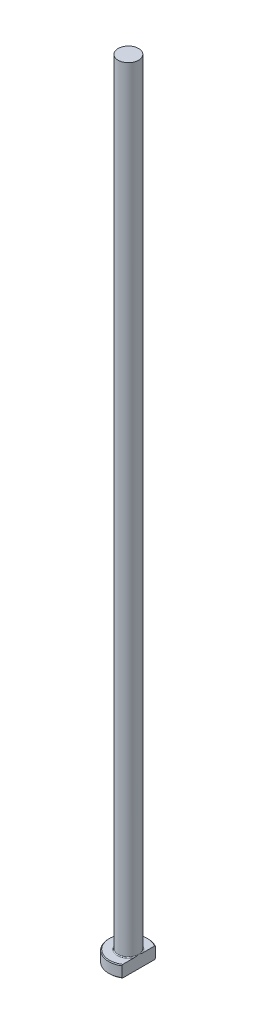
ISO-10303-21;
HEADER;
FILE_DESCRIPTION(('STEP AP214'),'2;1');
FILE_NAME('part.step','',(''),(''),'','','');
FILE_SCHEMA(('AUTOMOTIVE_DESIGN { 1 0 10303 214 1 1 1 1 }'));
ENDSEC;
DATA;
#1=APPLICATION_CONTEXT('core data for automotive mechanical design processes');
#2=APPLICATION_PROTOCOL_DEFINITION('international standard','automotive_design',2000,#1);
#3=PRODUCT_CONTEXT('',#1,'mechanical');
#4=PRODUCT('Part','Part','',(#3));
#5=PRODUCT_RELATED_PRODUCT_CATEGORY('part','',(#4));
#6=PRODUCT_DEFINITION_FORMATION('','',#4);
#7=PRODUCT_DEFINITION_CONTEXT('part definition',#1,'design');
#8=PRODUCT_DEFINITION('design','',#6,#7);
#9=PRODUCT_DEFINITION_SHAPE('','',#8);
#10=(LENGTH_UNIT() NAMED_UNIT(*) SI_UNIT(.MILLI.,.METRE.));
#11=(NAMED_UNIT(*) PLANE_ANGLE_UNIT() SI_UNIT($,.RADIAN.));
#12=(NAMED_UNIT(*) SI_UNIT($,.STERADIAN.) SOLID_ANGLE_UNIT());
#13=UNCERTAINTY_MEASURE_WITH_UNIT(LENGTH_MEASURE(1.E-05),#10,'distance_accuracy_value','');
#14=(GEOMETRIC_REPRESENTATION_CONTEXT(3) GLOBAL_UNCERTAINTY_ASSIGNED_CONTEXT((#13)) GLOBAL_UNIT_ASSIGNED_CONTEXT((#10,
#11,#12)) REPRESENTATION_CONTEXT('',''));
#15=CARTESIAN_POINT('',(0.,0.,0.));
#16=DIRECTION('',(0.,0.,1.));
#17=DIRECTION('',(1.,0.,0.));
#18=AXIS2_PLACEMENT_3D('',#15,#16,#17);
#19=CARTESIAN_POINT('',(0.,0.,0.));
#20=DIRECTION('',(0.,-1.,0.));
#21=DIRECTION('',(0.,0.,-1.));
#22=AXIS2_PLACEMENT_3D('',#19,#20,#21);
#23=PLANE('',#22);
#24=CARTESIAN_POINT('',(0.,0.,0.));
#25=DIRECTION('',(0.,-1.,0.));
#26=DIRECTION('',(0.,0.,-1.));
#27=AXIS2_PLACEMENT_3D('',#24,#25,#26);
#28=CIRCLE('',#27,4.79999999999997);
#29=CARTESIAN_POINT('',(2.59999999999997,0.,4.03484820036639));
#30=VERTEX_POINT('',#29);
#31=CARTESIAN_POINT('',(2.59999999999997,0.,-4.03484820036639));
#32=VERTEX_POINT('',#31);
#33=EDGE_CURVE('E98',#30,#32,#28,.T.);
#34=ORIENTED_EDGE('',*,*,#33,.T.);
#35=DIRECTION('',(0.,0.,1.));
#36=VECTOR('',#35,1.);
#37=CARTESIAN_POINT('',(2.59999999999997,0.,-4.27083130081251));
#38=LINE('',#37,#36);
#39=EDGE_CURVE('E83',#32,#30,#38,.T.);
#40=ORIENTED_EDGE('',*,*,#39,.T.);
#41=EDGE_LOOP('',(#34,#40));
#42=FACE_BOUND('',#41,.T.);
#43=ADVANCED_FACE('F32',(#42),#23,.T.);
#44=CARTESIAN_POINT('',(0.,259.958771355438,0.));
#45=DIRECTION('',(0.,1.,0.));
#46=DIRECTION('',(0.,0.,1.));
#47=AXIS2_PLACEMENT_3D('',#44,#45,#46);
#48=CYLINDRICAL_SURFACE('',#47,4.99999999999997);
#49=CARTESIAN_POINT('',(0.,2.79999999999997,0.));
#50=DIRECTION('',(0.,1.,0.));
#51=DIRECTION('',(0.,0.,1.));
#52=AXIS2_PLACEMENT_3D('',#49,#50,#51);
#53=CIRCLE('',#52,4.99999999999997);
#54=CARTESIAN_POINT('',(2.59999999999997,2.79999999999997,4.27083130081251));
#55=VERTEX_POINT('',#54);
#56=CARTESIAN_POINT('',(2.59999999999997,2.79999999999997,-4.27083130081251));
#57=VERTEX_POINT('',#56);
#58=EDGE_CURVE('E104',#55,#57,#53,.F.);
#59=ORIENTED_EDGE('',*,*,#58,.T.);
#60=DIRECTION('',(0.,-1.,0.));
#61=VECTOR('',#60,1.);
#62=CARTESIAN_POINT('',(2.59999999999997,200.,-4.27083130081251));
#63=LINE('',#62,#61);
#64=CARTESIAN_POINT('',(2.59999999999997,0.200000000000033,-4.27083130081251));
#65=VERTEX_POINT('',#64);
#66=EDGE_CURVE('E183',#57,#65,#63,.T.);
#67=ORIENTED_EDGE('',*,*,#66,.T.);
#68=CARTESIAN_POINT('',(0.,0.200000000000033,0.));
#69=DIRECTION('',(0.,-1.,0.));
#70=DIRECTION('',(0.,0.,-1.));
#71=AXIS2_PLACEMENT_3D('',#68,#69,#70);
#72=CIRCLE('',#71,4.99999999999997);
#73=CARTESIAN_POINT('',(2.59999999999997,0.200000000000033,4.27083130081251));
#74=VERTEX_POINT('',#73);
#75=EDGE_CURVE('E100',#65,#74,#72,.F.);
#76=ORIENTED_EDGE('',*,*,#75,.T.);
#77=DIRECTION('',(0.,-1.,0.));
#78=VECTOR('',#77,1.);
#79=CARTESIAN_POINT('',(2.59999999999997,200.,4.27083130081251));
#80=LINE('',#79,#78);
#81=EDGE_CURVE('E93',#55,#74,#80,.T.);
#82=ORIENTED_EDGE('',*,*,#81,.F.);
#83=EDGE_LOOP('',(#59,#67,#76,#82));
#84=FACE_BOUND('',#83,.T.);
#85=ADVANCED_FACE('F158',(#84),#48,.T.);
#86=CARTESIAN_POINT('',(-4.99999999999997,3.,0.));
#87=DIRECTION('',(0.,1.,0.));
#88=DIRECTION('',(0.,0.,1.));
#89=AXIS2_PLACEMENT_3D('',#86,#87,#88);
#90=PLANE('',#89);
#91=CARTESIAN_POINT('',(0.,3.,0.));
#92=DIRECTION('',(0.,1.,0.));
#93=DIRECTION('',(0.,0.,1.));
#94=AXIS2_PLACEMENT_3D('',#91,#92,#93);
#95=CIRCLE('',#94,4.79999999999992);
#96=CARTESIAN_POINT('',(2.59999999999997,3.,-4.03484820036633));
#97=VERTEX_POINT('',#96);
#98=CARTESIAN_POINT('',(2.59999999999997,3.,4.03484820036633));
#99=VERTEX_POINT('',#98);
#100=EDGE_CURVE('E178',#97,#99,#95,.T.);
#101=ORIENTED_EDGE('',*,*,#100,.T.);
#102=DIRECTION('',(0.,0.,-1.));
#103=VECTOR('',#102,1.);
#104=CARTESIAN_POINT('',(2.59999999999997,3.,0.));
#105=LINE('',#104,#103);
#106=CARTESIAN_POINT('',(2.59999999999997,2.99999999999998,1.03923048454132));
#107=VERTEX_POINT('',#106);
#108=EDGE_CURVE('E57',#99,#107,#105,.T.);
#109=ORIENTED_EDGE('',*,*,#108,.T.);
#110=CARTESIAN_POINT('',(0.,3.,0.));
#111=DIRECTION('',(0.,1.,0.));
#112=DIRECTION('',(0.,0.,1.));
#113=AXIS2_PLACEMENT_3D('',#110,#111,#112);
#114=CIRCLE('',#113,2.79999999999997);
#115=CARTESIAN_POINT('',(2.59999999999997,2.99999999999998,-1.03923048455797));
#116=VERTEX_POINT('',#115);
#117=EDGE_CURVE('E107',#107,#116,#114,.F.);
#118=ORIENTED_EDGE('',*,*,#117,.T.);
#119=EDGE_CURVE('E136',#116,#97,#105,.T.);
#120=ORIENTED_EDGE('',*,*,#119,.T.);
#121=EDGE_LOOP('',(#101,#109,#118,#120));
#122=FACE_BOUND('',#121,.T.);
#123=ADVANCED_FACE('F147',(#122),#90,.T.);
#124=CARTESIAN_POINT('',(0.,3.,0.));
#125=DIRECTION('',(0.,-1.,0.));
#126=DIRECTION('',(0.,0.,-1.));
#127=AXIS2_PLACEMENT_3D('',#124,#125,#126);
#128=CONICAL_SURFACE('',#127,4.79999999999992,0.785398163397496);
#129=ORIENTED_EDGE('',*,*,#58,.F.);
#130=CARTESIAN_POINT('',(2.59999999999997,-1.95047472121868,9.397433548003));
#131=CARTESIAN_POINT('',(2.59999999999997,-1.76015203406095,9.19995130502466));
#132=CARTESIAN_POINT('',(2.59999999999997,-1.57004107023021,9.0022644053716));
#133=CARTESIAN_POINT('',(2.59999999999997,-1.19035454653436,8.60637345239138));
#134=CARTESIAN_POINT('',(2.59999999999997,-1.00077899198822,8.40816939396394));
#135=CARTESIAN_POINT('',(2.59999999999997,-0.622208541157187,8.01106626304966));
#136=CARTESIAN_POINT('',(2.59999999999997,-0.43321388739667,7.81216695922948));
#137=CARTESIAN_POINT('',(2.59999999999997,-0.0560371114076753,7.41360059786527));
#138=CARTESIAN_POINT('',(2.59999999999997,0.132145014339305,7.21393354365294));
#139=CARTESIAN_POINT('',(2.59999999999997,0.504316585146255,6.81701377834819));
#140=CARTESIAN_POINT('',(2.59999999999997,0.688323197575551,6.61977717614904));
#141=CARTESIAN_POINT('',(2.59999999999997,1.05506202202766,6.22412305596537));
#142=CARTESIAN_POINT('',(2.59999999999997,1.23779424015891,6.02570554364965));
#143=CARTESIAN_POINT('',(2.59999999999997,1.60155525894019,5.62737135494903));
#144=CARTESIAN_POINT('',(2.59999999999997,1.78258432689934,5.42745492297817));
#145=CARTESIAN_POINT('',(2.59999999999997,2.14238277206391,5.02560172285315));
#146=CARTESIAN_POINT('',(2.59999999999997,2.32115220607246,4.82366500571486));
#147=CARTESIAN_POINT('',(2.59999999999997,2.62527031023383,4.4746966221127));
#148=CARTESIAN_POINT('',(2.59999999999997,2.75138938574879,4.32833728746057));
#149=CARTESIAN_POINT('',(2.59999999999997,3.00151582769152,4.03379615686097));
#150=CARTESIAN_POINT('',(2.59999999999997,3.12552298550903,3.88561418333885));
#151=CARTESIAN_POINT('',(2.59999999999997,3.37190002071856,3.58545728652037));
#152=CARTESIAN_POINT('',(2.59999999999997,3.49424212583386,3.43345946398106));
#153=CARTESIAN_POINT('',(2.59999999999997,3.73490070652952,3.12636139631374));
#154=CARTESIAN_POINT('',(2.59999999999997,3.85321820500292,2.97126195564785));
#155=CARTESIAN_POINT('',(2.59999999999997,4.08579009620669,2.65464223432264));
#156=CARTESIAN_POINT('',(2.59999999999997,4.19996477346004,2.49306256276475));
#157=CARTESIAN_POINT('',(2.59999999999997,4.36468341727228,2.24613590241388));
#158=CARTESIAN_POINT('',(2.59999999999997,4.41853818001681,2.16300143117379));
#159=CARTESIAN_POINT('',(2.59999999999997,4.52346182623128,1.99499855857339));
#160=CARTESIAN_POINT('',(2.59999999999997,4.57453099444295,1.9101303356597));
#161=CARTESIAN_POINT('',(2.59999999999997,4.67263274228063,1.7393256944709));
#162=CARTESIAN_POINT('',(2.59999999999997,4.7197040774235,1.65341183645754));
#163=CARTESIAN_POINT('',(2.59999999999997,4.80952240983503,1.47936505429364));
#164=CARTESIAN_POINT('',(2.59999999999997,4.85226857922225,1.3912317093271));
#165=CARTESIAN_POINT('',(2.59999999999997,4.97211006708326,1.12354274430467));
#166=CARTESIAN_POINT('',(2.59999999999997,5.04118725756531,0.940070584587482));
#167=CARTESIAN_POINT('',(2.59999999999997,5.11752261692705,0.665284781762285));
#168=CARTESIAN_POINT('',(2.59999999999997,5.13802992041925,0.577624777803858));
#169=CARTESIAN_POINT('',(2.59999999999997,5.17073291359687,0.400736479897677));
#170=CARTESIAN_POINT('',(2.59999999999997,5.18292955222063,0.311508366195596));
#171=CARTESIAN_POINT('',(2.59999999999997,5.19813789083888,0.13262811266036));
#172=CARTESIAN_POINT('',(2.59999999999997,5.20118701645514,0.0429792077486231));
#173=CARTESIAN_POINT('',(2.59999999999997,5.19797827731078,-0.13615453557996));
#174=CARTESIAN_POINT('',(2.59999999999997,5.19171987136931,-0.225639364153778));
#175=CARTESIAN_POINT('',(2.59999999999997,5.17043196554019,-0.402893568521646));
#176=CARTESIAN_POINT('',(2.59999999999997,5.15546490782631,-0.49067060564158));
#177=CARTESIAN_POINT('',(2.59999999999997,5.11776551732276,-0.664523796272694));
#178=CARTESIAN_POINT('',(2.59999999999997,5.09503206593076,-0.750599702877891));
#179=CARTESIAN_POINT('',(2.59999999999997,5.04281440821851,-0.921261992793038));
#180=CARTESIAN_POINT('',(2.59999999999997,5.01328729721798,-1.00583506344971));
#181=CARTESIAN_POINT('',(2.59999999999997,4.94875799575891,-1.17281894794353));
#182=CARTESIAN_POINT('',(2.59999999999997,4.91375683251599,-1.25523016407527));
#183=CARTESIAN_POINT('',(2.59999999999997,4.80599778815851,-1.49096020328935));
#184=CARTESIAN_POINT('',(2.59999999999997,4.72750956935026,-1.64165062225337));
#185=CARTESIAN_POINT('',(2.59999999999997,4.55999715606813,-1.93711610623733));
#186=CARTESIAN_POINT('',(2.59999999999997,4.47096030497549,-2.08188377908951));
#187=CARTESIAN_POINT('',(2.59999999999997,4.28541544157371,-2.36729512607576));
#188=CARTESIAN_POINT('',(2.59999999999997,4.18888021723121,-2.50792095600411));
#189=CARTESIAN_POINT('',(2.59999999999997,3.99085344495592,-2.78550445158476));
#190=CARTESIAN_POINT('',(2.59999999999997,3.88936425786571,-2.92246381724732));
#191=CARTESIAN_POINT('',(2.59999999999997,3.68147097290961,-3.19533708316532));
#192=CARTESIAN_POINT('',(2.59999999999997,3.57502092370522,-3.3312158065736));
#193=CARTESIAN_POINT('',(2.59999999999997,3.35937457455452,-3.60078977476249));
#194=CARTESIAN_POINT('',(2.59999999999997,3.25017800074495,-3.7344847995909));
#195=CARTESIAN_POINT('',(2.59999999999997,3.02996614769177,-3.99983567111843));
#196=CARTESIAN_POINT('',(2.59999999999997,2.91895572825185,-4.1314955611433));
#197=CARTESIAN_POINT('',(2.59999999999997,2.69532568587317,-4.39344289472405));
#198=CARTESIAN_POINT('',(2.59999999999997,2.58270603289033,-4.52373031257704));
#199=CARTESIAN_POINT('',(2.59999999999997,2.28823888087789,-4.86104966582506));
#200=CARTESIAN_POINT('',(2.59999999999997,2.10540318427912,-5.06721827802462));
#201=CARTESIAN_POINT('',(2.59999999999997,1.73743041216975,-5.47749422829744));
#202=CARTESIAN_POINT('',(2.59999999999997,1.55229327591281,-5.68160151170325));
#203=CARTESIAN_POINT('',(2.59999999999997,1.18015264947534,-6.08844300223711));
#204=CARTESIAN_POINT('',(2.59999999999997,0.993147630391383,-6.29117580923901));
#205=CARTESIAN_POINT('',(2.59999999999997,0.617846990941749,-6.69544313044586));
#206=CARTESIAN_POINT('',(2.59999999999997,0.429551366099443,-6.89697764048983));
#207=CARTESIAN_POINT('',(2.59999999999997,0.0594707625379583,-7.29110398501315));
#208=CARTESIAN_POINT('',(2.59999999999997,-0.122275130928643,-7.48373254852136));
#209=CARTESIAN_POINT('',(2.59999999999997,-0.486506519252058,-7.86829020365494));
#210=CARTESIAN_POINT('',(2.59999999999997,-0.668992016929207,-8.06021929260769));
#211=CARTESIAN_POINT('',(2.59999999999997,-1.03436396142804,-8.44329936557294));
#212=CARTESIAN_POINT('',(2.59999999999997,-1.21724976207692,-8.63445096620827));
#213=CARTESIAN_POINT('',(2.59999999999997,-1.58351605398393,-9.01627657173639));
#214=CARTESIAN_POINT('',(2.59999999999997,-1.76689654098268,-9.20695058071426));
#215=CARTESIAN_POINT('',(2.59999999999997,-1.95047472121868,-9.397433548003));
#216=B_SPLINE_CURVE_WITH_KNOTS('',3,(#130,#131,#132,#133,#134,#135,#136,#137,#138,#139,#140,
#141,#142,#143,#144,#145,#146,#147,#148,#149,#150,#151,#152,#153,#154,#155,#156,#157,#158,#159,
#160,#161,#162,#163,#164,#165,#166,#167,#168,#169,#170,#171,#172,#173,#174,#175,#176,#177,#178,
#179,#180,#181,#182,#183,#184,#185,#186,#187,#188,#189,#190,#191,#192,#193,#194,#195,#196,#197,
#198,#199,#200,#201,#202,#203,#204,#205,#206,#207,#208,#209,#210,#211,#212,#213,#214,#215),
.UNSPECIFIED.,.F.,.F.,(4,2,2,2,2,2,2,2,2,2,2,2,2,2,2,2,2,2,2,2,2,2,2,2,2,2,2,2,2,2,2,2,2,2,2,2,
2,2,2,2,2,2,4),(0.,0.822799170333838,1.64560648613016,2.46872021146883,3.29183036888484,
4.10105194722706,4.91026964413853,5.71935814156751,6.5284262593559,7.10801764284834,
7.68766594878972,8.27296873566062,8.85812163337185,9.45143823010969,9.74855643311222,
10.0456442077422,10.3394095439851,10.6332310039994,11.2186835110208,11.4884410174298,
11.7581677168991,12.0267893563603,12.2954266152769,12.5621610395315,12.8289338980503,
13.0974401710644,13.3658961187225,13.8748906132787,14.3845021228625,14.896058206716,
15.4073728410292,15.9251595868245,16.4429981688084,16.9596236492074,17.4762587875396,
18.3029176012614,19.1295982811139,19.9570225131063,20.7844496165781,21.5789508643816,
22.3734551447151,23.1671010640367,23.9607401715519),.UNSPECIFIED.);
#217=EDGE_CURVE('E135',#55,#99,#216,.T.);
#218=ORIENTED_EDGE('',*,*,#217,.T.);
#219=ORIENTED_EDGE('',*,*,#100,.F.);
#220=EDGE_CURVE('E127',#97,#57,#216,.T.);
#221=ORIENTED_EDGE('',*,*,#220,.T.);
#222=EDGE_LOOP('',(#129,#218,#219,#221));
#223=FACE_BOUND('',#222,.T.);
#224=ADVANCED_FACE('F143',(#223),#128,.T.);
#225=CARTESIAN_POINT('',(0.,0.200000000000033,0.));
#226=DIRECTION('',(0.,1.,0.));
#227=DIRECTION('',(0.,0.,1.));
#228=AXIS2_PLACEMENT_3D('',#225,#226,#227);
#229=CONICAL_SURFACE('',#228,4.99999999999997,0.785398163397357);
#230=ORIENTED_EDGE('',*,*,#75,.F.);
#231=CARTESIAN_POINT('',(2.59999999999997,4.95047472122,-9.397433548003));
#232=CARTESIAN_POINT('',(2.59999999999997,4.7601520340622,-9.19995130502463));
#233=CARTESIAN_POINT('',(2.59999999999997,4.57004107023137,-9.00226440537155));
#234=CARTESIAN_POINT('',(2.59999999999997,4.19035454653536,-8.60637345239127));
#235=CARTESIAN_POINT('',(2.59999999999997,4.00077899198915,-8.4081693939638));
#236=CARTESIAN_POINT('',(2.59999999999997,3.62220854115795,-8.01106626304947));
#237=CARTESIAN_POINT('',(2.59999999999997,3.43321388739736,-7.81216695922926));
#238=CARTESIAN_POINT('',(2.59999999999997,3.05603711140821,-7.41360059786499));
#239=CARTESIAN_POINT('',(2.59999999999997,2.86785498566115,-7.21393354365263));
#240=CARTESIAN_POINT('',(2.59999999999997,2.49568341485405,-6.81701377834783));
#241=CARTESIAN_POINT('',(2.59999999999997,2.31167680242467,-6.61977717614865));
#242=CARTESIAN_POINT('',(2.59999999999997,1.94493797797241,-6.22412305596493));
#243=CARTESIAN_POINT('',(2.59999999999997,1.7622057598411,-6.02570554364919));
#244=CARTESIAN_POINT('',(2.59999999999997,1.39844474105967,-5.62737135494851));
#245=CARTESIAN_POINT('',(2.59999999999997,1.21741567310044,-5.42745492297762));
#246=CARTESIAN_POINT('',(2.59999999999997,0.85761722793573,-5.02560172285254));
#247=CARTESIAN_POINT('',(2.59999999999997,0.678847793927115,-4.82366500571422));
#248=CARTESIAN_POINT('',(2.59999999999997,0.374729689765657,-4.47469662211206));
#249=CARTESIAN_POINT('',(2.59999999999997,0.248610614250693,-4.32833728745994));
#250=CARTESIAN_POINT('',(2.59999999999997,-0.00151582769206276,-4.03379615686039));
#251=CARTESIAN_POINT('',(2.59999999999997,-0.125522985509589,-3.88561418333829));
#252=CARTESIAN_POINT('',(2.59999999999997,-0.371900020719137,-3.58545728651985));
#253=CARTESIAN_POINT('',(2.59999999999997,-0.494242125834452,-3.43345946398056));
#254=CARTESIAN_POINT('',(2.59999999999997,-0.734900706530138,-3.12636139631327));
#255=CARTESIAN_POINT('',(2.59999999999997,-0.853218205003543,-2.9712619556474));
#256=CARTESIAN_POINT('',(2.59999999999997,-1.08579009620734,-2.65464223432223));
#257=CARTESIAN_POINT('',(2.59999999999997,-1.1999647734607,-2.49306256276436));
#258=CARTESIAN_POINT('',(2.59999999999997,-1.36468341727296,-2.2461359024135));
#259=CARTESIAN_POINT('',(2.59999999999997,-1.41853818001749,-2.16300143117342));
#260=CARTESIAN_POINT('',(2.59999999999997,-1.52346182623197,-1.99499855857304));
#261=CARTESIAN_POINT('',(2.59999999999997,-1.57453099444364,-1.91013033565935));
#262=CARTESIAN_POINT('',(2.59999999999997,-1.67263274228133,-1.73932569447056));
#263=CARTESIAN_POINT('',(2.59999999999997,-1.71970407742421,-1.65341183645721));
#264=CARTESIAN_POINT('',(2.59999999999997,-1.80952240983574,-1.47936505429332));
#265=CARTESIAN_POINT('',(2.59999999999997,-1.85226857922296,-1.39123170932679));
#266=CARTESIAN_POINT('',(2.59999999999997,-1.97211006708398,-1.12354274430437));
#267=CARTESIAN_POINT('',(2.59999999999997,-2.04118725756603,-0.94007058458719));
#268=CARTESIAN_POINT('',(2.59999999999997,-2.11752261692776,-0.66528478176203));
#269=CARTESIAN_POINT('',(2.59999999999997,-2.13802992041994,-0.577624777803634));
#270=CARTESIAN_POINT('',(2.59999999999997,-2.17073291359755,-0.400736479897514));
#271=CARTESIAN_POINT('',(2.59999999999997,-2.1829295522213,-0.311508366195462));
#272=CARTESIAN_POINT('',(2.59999999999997,-2.19813789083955,-0.132628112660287));
#273=CARTESIAN_POINT('',(2.59999999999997,-2.2011870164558,-0.0429792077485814));
#274=CARTESIAN_POINT('',(2.59999999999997,-2.19797827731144,0.13615453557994));
#275=CARTESIAN_POINT('',(2.59999999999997,-2.19171987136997,0.225639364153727));
#276=CARTESIAN_POINT('',(2.59999999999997,-2.17043196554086,0.402893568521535));
#277=CARTESIAN_POINT('',(2.59999999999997,-2.15546490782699,0.490670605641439));
#278=CARTESIAN_POINT('',(2.59999999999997,-2.11776551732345,0.664523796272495));
#279=CARTESIAN_POINT('',(2.59999999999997,-2.09503206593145,0.750599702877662));
#280=CARTESIAN_POINT('',(2.59999999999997,-2.04281440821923,0.92126199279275));
#281=CARTESIAN_POINT('',(2.59999999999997,-2.0132872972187,1.00583506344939));
#282=CARTESIAN_POINT('',(2.59999999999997,-1.94875799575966,1.17281894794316));
#283=CARTESIAN_POINT('',(2.59999999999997,-1.91375683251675,1.25523016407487));
#284=CARTESIAN_POINT('',(2.59999999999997,-1.80599778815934,1.49096020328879));
#285=CARTESIAN_POINT('',(2.59999999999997,-1.72750956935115,1.6416506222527));
#286=CARTESIAN_POINT('',(2.59999999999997,-1.55999715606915,1.93711610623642));
#287=CARTESIAN_POINT('',(2.59999999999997,-1.47096030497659,2.08188377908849));
#288=CARTESIAN_POINT('',(2.59999999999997,-1.28541544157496,2.36729512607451));
#289=CARTESIAN_POINT('',(2.59999999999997,-1.18888021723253,2.50792095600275));
#290=CARTESIAN_POINT('',(2.59999999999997,-0.990853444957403,2.78550445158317));
#291=CARTESIAN_POINT('',(2.59999999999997,-0.889364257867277,2.92246381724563));
#292=CARTESIAN_POINT('',(2.59999999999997,-0.681470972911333,3.19533708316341));
#293=CARTESIAN_POINT('',(2.59999999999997,-0.575020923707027,3.33121580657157));
#294=CARTESIAN_POINT('',(2.59999999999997,-0.359374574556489,3.60078977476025));
#295=CARTESIAN_POINT('',(2.59999999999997,-0.250178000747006,3.73448479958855));
#296=CARTESIAN_POINT('',(2.59999999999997,-0.0299661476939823,3.99983567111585));
#297=CARTESIAN_POINT('',(2.59999999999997,0.0810442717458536,4.13149556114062));
#298=CARTESIAN_POINT('',(2.59999999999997,0.304674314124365,4.39344289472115));
#299=CARTESIAN_POINT('',(2.59999999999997,0.417293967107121,4.52373031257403));
#300=CARTESIAN_POINT('',(2.59999999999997,0.711761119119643,4.8610496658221));
#301=CARTESIAN_POINT('',(2.59999999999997,0.894596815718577,5.06721827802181));
#302=CARTESIAN_POINT('',(2.59999999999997,1.26256958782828,5.47749422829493));
#303=CARTESIAN_POINT('',(2.59999999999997,1.44770672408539,5.68160151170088));
#304=CARTESIAN_POINT('',(2.59999999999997,1.8198473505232,6.08844300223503));
#305=CARTESIAN_POINT('',(2.59999999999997,2.00685236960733,6.29117580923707));
#306=CARTESIAN_POINT('',(2.59999999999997,2.38215300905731,6.6954431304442));
#307=CARTESIAN_POINT('',(2.59999999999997,2.5704486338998,6.89697764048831));
#308=CARTESIAN_POINT('',(2.59999999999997,2.94052923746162,7.29110398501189));
#309=CARTESIAN_POINT('',(2.59999999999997,3.12227513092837,7.48373254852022));
#310=CARTESIAN_POINT('',(2.59999999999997,3.48650651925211,7.86829020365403));
#311=CARTESIAN_POINT('',(2.59999999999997,3.66899201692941,8.06021929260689));
#312=CARTESIAN_POINT('',(2.59999999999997,4.03436396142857,8.44329936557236));
#313=CARTESIAN_POINT('',(2.59999999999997,4.21724976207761,8.63445096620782));
#314=CARTESIAN_POINT('',(2.59999999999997,4.58351605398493,9.01627657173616));
#315=CARTESIAN_POINT('',(2.59999999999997,4.76689654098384,9.20695058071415));
#316=CARTESIAN_POINT('',(2.59999999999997,4.95047472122,9.397433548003));
#317=B_SPLINE_CURVE_WITH_KNOTS('',3,(#231,#232,#233,#234,#235,#236,#237,#238,#239,#240,#241,
#242,#243,#244,#245,#246,#247,#248,#249,#250,#251,#252,#253,#254,#255,#256,#257,#258,#259,#260,
#261,#262,#263,#264,#265,#266,#267,#268,#269,#270,#271,#272,#273,#274,#275,#276,#277,#278,#279,
#280,#281,#282,#283,#284,#285,#286,#287,#288,#289,#290,#291,#292,#293,#294,#295,#296,#297,#298,
#299,#300,#301,#302,#303,#304,#305,#306,#307,#308,#309,#310,#311,#312,#313,#314,#315,#316),
.UNSPECIFIED.,.F.,.F.,(4,2,2,2,2,2,2,2,2,2,2,2,2,2,2,2,2,2,2,2,2,2,2,2,2,2,2,2,2,2,2,2,2,2,2,2,
2,2,2,2,2,2,4),(0.,0.822799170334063,1.64560648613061,2.4687202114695,3.29183036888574,
4.10105194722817,4.91026964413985,5.71935814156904,6.52842625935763,7.10801764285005,
7.68766594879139,8.27296873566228,8.85812163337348,9.4514382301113,9.74855643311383,
10.0456442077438,10.3394095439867,10.633231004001,11.2186835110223,11.4884410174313,
11.7581677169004,12.0267893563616,12.2954266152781,12.5621610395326,12.8289338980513,
13.0974401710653,13.3658961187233,13.8748906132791,14.3845021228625,14.8960582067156,
15.4073728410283,15.9251595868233,16.4429981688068,16.9596236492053,17.4762587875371,
18.3029176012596,19.1295982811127,19.9570225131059,20.7844496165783,21.5789508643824,
22.3734551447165,23.1671010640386,23.9607401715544),.UNSPECIFIED.);
#318=EDGE_CURVE('E86',#65,#32,#317,.T.);
#319=ORIENTED_EDGE('',*,*,#318,.T.);
#320=ORIENTED_EDGE('',*,*,#33,.F.);
#321=EDGE_CURVE('E89',#30,#74,#317,.T.);
#322=ORIENTED_EDGE('',*,*,#321,.T.);
#323=EDGE_LOOP('',(#230,#319,#320,#322));
#324=FACE_BOUND('',#323,.T.);
#325=ADVANCED_FACE('F97',(#324),#229,.T.);
#326=CARTESIAN_POINT('',(0.,3.19999999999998,0.));
#327=DIRECTION('',(0.,1.,0.));
#328=DIRECTION('',(0.,0.,1.));
#329=AXIS2_PLACEMENT_3D('',#326,#327,#328);
#330=TOROIDAL_SURFACE('',#329,2.79999999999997,0.2);
#331=CARTESIAN_POINT('',(2.59999999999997,3.19999999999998,0.));
#332=CARTESIAN_POINT('',(2.59999999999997,3.20000050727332,1.23579409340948E-10));
#333=CARTESIAN_POINT('',(2.59999999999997,3.20000101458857,-1.74789552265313E-07));
#334=CARTESIAN_POINT('',(2.59999999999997,3.20000196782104,-6.73287793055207E-07));
#335=CARTESIAN_POINT('',(2.59999999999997,3.20000240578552,-1.00747163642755E-06));
#336=CARTESIAN_POINT('',(2.59999999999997,3.20000330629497,-1.80604944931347E-06));
#337=CARTESIAN_POINT('',(2.59999999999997,3.20000375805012,-2.28310921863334E-06));
#338=CARTESIAN_POINT('',(2.59999999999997,3.20000457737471,-3.28018171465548E-06));
#339=CARTESIAN_POINT('',(2.59999999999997,3.20000494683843,-3.79874305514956E-06));
#340=CARTESIAN_POINT('',(2.59999999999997,3.20000629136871,-5.77594334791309E-06));
#341=CARTESIAN_POINT('',(2.59999999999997,3.20000719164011,-7.28765589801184E-06));
#342=CARTESIAN_POINT('',(2.59999999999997,3.20000869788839,-1.03067582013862E-05));
#343=CARTESIAN_POINT('',(2.59999999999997,3.20000932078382,-1.18060929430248E-05));
#344=CARTESIAN_POINT('',(2.59999999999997,3.20001188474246,-1.80612988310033E-05));
#345=CARTESIAN_POINT('',(2.59999999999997,3.20001376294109,-2.28467812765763E-05));
#346=CARTESIAN_POINT('',(2.59999999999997,3.20001657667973,-3.19530305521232E-05));
#347=CARTESIAN_POINT('',(2.59999999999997,3.20001760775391,-3.62442681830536E-05));
#348=CARTESIAN_POINT('',(2.59999999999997,3.20002504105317,-6.7868346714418E-05));
#349=CARTESIAN_POINT('',(2.59999999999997,3.20003059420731,-9.53536176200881E-05));
#350=CARTESIAN_POINT('',(2.59999999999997,3.20005490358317,-0.000203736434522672));
#351=CARTESIAN_POINT('',(2.59999999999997,3.20007818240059,-0.000283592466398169));
#352=CARTESIAN_POINT('',(2.59999999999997,3.2001686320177,-0.000599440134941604));
#353=CARTESIAN_POINT('',(2.59999999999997,3.2002328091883,-0.000836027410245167));
#354=CARTESIAN_POINT('',(2.59999999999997,3.20048945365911,-0.00177477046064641));
#355=CARTESIAN_POINT('',(2.59999999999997,3.20068565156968,-0.00247616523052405));
#356=CARTESIAN_POINT('',(2.59999999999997,3.20149940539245,-0.0053934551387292));
#357=CARTESIAN_POINT('',(2.59999999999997,3.20211229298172,-0.007610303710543));
#358=CARTESIAN_POINT('',(2.59999999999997,3.2076646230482,-0.0276831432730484));
#359=CARTESIAN_POINT('',(2.59999999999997,3.21262302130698,-0.0455354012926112));
#360=CARTESIAN_POINT('',(2.59999999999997,3.22230897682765,-0.0805439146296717));
#361=CARTESIAN_POINT('',(2.59999999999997,3.22703791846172,-0.0976998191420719));
#362=CARTESIAN_POINT('',(2.59999999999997,3.23705035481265,-0.134181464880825));
#363=CARTESIAN_POINT('',(2.59999999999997,3.2423287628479,-0.153508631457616));
#364=CARTESIAN_POINT('',(2.59999999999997,3.25286316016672,-0.192393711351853));
#365=CARTESIAN_POINT('',(2.59999999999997,3.25811828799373,-0.211951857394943));
#366=CARTESIAN_POINT('',(2.59999999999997,3.27070509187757,-0.259316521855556));
#367=CARTESIAN_POINT('',(2.59999999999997,3.27798202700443,-0.287137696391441));
#368=CARTESIAN_POINT('',(2.59999999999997,3.29204094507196,-0.342105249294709));
#369=CARTESIAN_POINT('',(2.59999999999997,3.29883098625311,-0.36924957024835));
#370=CARTESIAN_POINT('',(2.59999999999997,3.32069835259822,-0.459246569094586));
#371=CARTESIAN_POINT('',(2.59999999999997,3.33498012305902,-0.522296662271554));
#372=CARTESIAN_POINT('',(2.59999999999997,3.36056532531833,-0.649787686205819));
#373=CARTESIAN_POINT('',(2.59999999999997,3.37183254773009,-0.714236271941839));
#374=CARTESIAN_POINT('',(2.59999999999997,3.38542084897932,-0.81395858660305));
#375=CARTESIAN_POINT('',(2.59999999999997,3.38947199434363,-0.84899397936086));
#376=CARTESIAN_POINT('',(2.59999999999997,3.39578733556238,-0.91922149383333));
#377=CARTESIAN_POINT('',(2.59999999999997,3.39805216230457,-0.954413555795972));
#378=CARTESIAN_POINT('',(2.59999999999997,3.40031330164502,-1.02465521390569));
#379=CARTESIAN_POINT('',(2.59999999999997,3.40032384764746,-1.05970430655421));
#380=CARTESIAN_POINT('',(2.59999999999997,3.39745377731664,-1.1296713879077));
#381=CARTESIAN_POINT('',(2.59999999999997,3.39457726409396,-1.16458949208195));
#382=CARTESIAN_POINT('',(2.59999999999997,3.38762659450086,-1.21434358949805));
#383=CARTESIAN_POINT('',(2.59999999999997,3.3851418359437,-1.22940327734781));
#384=CARTESIAN_POINT('',(2.59999999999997,3.37928992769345,-1.25936829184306));
#385=CARTESIAN_POINT('',(2.59999999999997,3.37592199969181,-1.27427347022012));
#386=CARTESIAN_POINT('',(2.59999999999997,3.36819593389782,-1.30360801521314));
#387=CARTESIAN_POINT('',(2.59999999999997,3.36385215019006,-1.31804111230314));
#388=CARTESIAN_POINT('',(2.59999999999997,3.35394180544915,-1.34647366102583));
#389=CARTESIAN_POINT('',(2.59999999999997,3.34837682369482,-1.36047364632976));
#390=CARTESIAN_POINT('',(2.59999999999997,3.3378467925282,-1.3832098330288));
#391=CARTESIAN_POINT('',(2.59999999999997,3.33330355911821,-1.39214053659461));
#392=CARTESIAN_POINT('',(2.59999999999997,3.32341812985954,-1.40958482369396));
#393=CARTESIAN_POINT('',(2.59999999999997,3.31807401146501,-1.41809733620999));
#394=CARTESIAN_POINT('',(2.59999999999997,3.3064185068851,-1.43453575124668));
#395=CARTESIAN_POINT('',(2.59999999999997,3.30010038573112,-1.44245695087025));
#396=CARTESIAN_POINT('',(2.59999999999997,3.28637957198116,-1.45729976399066));
#397=CARTESIAN_POINT('',(2.59999999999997,3.27897945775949,-1.46422367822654));
#398=CARTESIAN_POINT('',(2.59999999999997,3.26567821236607,-1.47448129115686));
#399=CARTESIAN_POINT('',(2.59999999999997,3.26010727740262,-1.47824010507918));
#400=CARTESIAN_POINT('',(2.59999999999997,3.24845655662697,-1.48487520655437));
#401=CARTESIAN_POINT('',(2.59999999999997,3.24237710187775,-1.4877520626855));
#402=CARTESIAN_POINT('',(2.59999999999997,3.22972757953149,-1.49241784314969));
#403=CARTESIAN_POINT('',(2.59999999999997,3.22315282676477,-1.49419437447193));
#404=CARTESIAN_POINT('',(2.59999999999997,3.20978231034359,-1.49640812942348));
#405=CARTESIAN_POINT('',(2.59999999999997,3.20298682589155,-1.49684698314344));
#406=CARTESIAN_POINT('',(2.59999999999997,3.19037691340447,-1.49637060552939));
#407=CARTESIAN_POINT('',(2.59999999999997,3.18455503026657,-1.49563180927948));
#408=CARTESIAN_POINT('',(2.59999999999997,3.17311801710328,-1.49319000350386));
#409=CARTESIAN_POINT('',(2.59999999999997,3.1675030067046,-1.49148644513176));
#410=CARTESIAN_POINT('',(2.59999999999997,3.15514195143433,-1.48668054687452));
#411=CARTESIAN_POINT('',(2.59999999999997,3.14849468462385,-1.48332605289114));
#412=CARTESIAN_POINT('',(2.59999999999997,3.13582833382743,-1.47559145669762));
#413=CARTESIAN_POINT('',(2.59999999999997,3.12981053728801,-1.47120930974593));
#414=CARTESIAN_POINT('',(2.59999999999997,3.11535552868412,-1.45914343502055));
#415=CARTESIAN_POINT('',(2.59999999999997,3.10734855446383,-1.45094839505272));
#416=CARTESIAN_POINT('',(2.59999999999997,3.09265977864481,-1.43346680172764));
#417=CARTESIAN_POINT('',(2.59999999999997,3.08598026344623,-1.4241784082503));
#418=CARTESIAN_POINT('',(2.59999999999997,3.06857102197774,-1.39681642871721));
#419=CARTESIAN_POINT('',(2.59999999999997,3.05915220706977,-1.37791719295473));
#420=CARTESIAN_POINT('',(2.59999999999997,3.04297062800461,-1.3389290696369));
#421=CARTESIAN_POINT('',(2.59999999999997,3.03622846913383,-1.31883227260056));
#422=CARTESIAN_POINT('',(2.59999999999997,3.02432998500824,-1.27632728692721));
#423=CARTESIAN_POINT('',(2.59999999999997,3.01935848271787,-1.25386836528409));
#424=CARTESIAN_POINT('',(2.59999999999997,3.01130018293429,-1.20858750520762));
#425=CARTESIAN_POINT('',(2.59999999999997,3.00821705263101,-1.18576494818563));
#426=CARTESIAN_POINT('',(2.59999999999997,3.00363796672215,-1.1405967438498));
#427=CARTESIAN_POINT('',(2.59999999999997,3.00210096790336,-1.11825509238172));
#428=CARTESIAN_POINT('',(2.59999999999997,3.00022491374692,-1.07361049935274));
#429=CARTESIAN_POINT('',(2.59999999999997,2.99988136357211,-1.05130772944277));
#430=CARTESIAN_POINT('',(2.59999999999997,3.00029323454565,-0.991792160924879));
#431=CARTESIAN_POINT('',(2.59999999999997,3.00193756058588,-0.954585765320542));
#432=CARTESIAN_POINT('',(2.59999999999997,3.00736147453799,-0.880345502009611));
#433=CARTESIAN_POINT('',(2.59999999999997,3.01114096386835,-0.843311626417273));
#434=CARTESIAN_POINT('',(2.59999999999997,3.02049059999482,-0.768589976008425));
#435=CARTESIAN_POINT('',(2.59999999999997,3.02610078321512,-0.730907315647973));
#436=CARTESIAN_POINT('',(2.59999999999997,3.0387231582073,-0.655686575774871));
#437=CARTESIAN_POINT('',(2.59999999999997,3.0457387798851,-0.618149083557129));
#438=CARTESIAN_POINT('',(2.59999999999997,3.06358120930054,-0.52980872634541));
#439=CARTESIAN_POINT('',(2.59999999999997,3.07487037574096,-0.479100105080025));
#440=CARTESIAN_POINT('',(2.59999999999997,3.09870164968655,-0.378576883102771));
#441=CARTESIAN_POINT('',(2.59999999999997,3.1112285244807,-0.328758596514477));
#442=CARTESIAN_POINT('',(2.59999999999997,3.13564556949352,-0.234990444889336));
#443=CARTESIAN_POINT('',(2.59999999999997,3.14744634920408,-0.191016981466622));
#444=CARTESIAN_POINT('',(2.59999999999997,3.17192746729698,-0.101304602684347));
#445=CARTESIAN_POINT('',(2.59999999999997,3.18462387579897,-0.0555700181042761));
#446=CARTESIAN_POINT('',(2.59999999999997,3.19788889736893,-0.00760560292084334));
#447=CARTESIAN_POINT('',(2.59999999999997,3.19850316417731,-0.00538409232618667));
#448=CARTESIAN_POINT('',(2.59999999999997,3.19931724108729,-0.00246573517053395));
#449=CARTESIAN_POINT('',(2.59999999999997,3.19951242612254,-0.00176794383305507));
#450=CARTESIAN_POINT('',(2.59999999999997,3.19976783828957,-0.000833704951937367));
#451=CARTESIAN_POINT('',(2.59999999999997,3.19983177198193,-0.000598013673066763));
#452=CARTESIAN_POINT('',(2.59999999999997,3.19992192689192,-0.000283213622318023));
#453=CARTESIAN_POINT('',(2.59999999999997,3.19994516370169,-0.00020351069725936));
#454=CARTESIAN_POINT('',(2.59999999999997,3.19996943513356,-9.53048357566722E-05));
#455=CARTESIAN_POINT('',(2.59999999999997,3.19997498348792,-6.78414250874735E-05));
#456=CARTESIAN_POINT('',(2.59999999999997,3.1999824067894,-3.62395621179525E-05));
#457=CARTESIAN_POINT('',(2.59999999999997,3.19998343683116,-3.19495761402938E-05));
#458=CARTESIAN_POINT('',(2.59999999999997,3.19998624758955,-2.2845859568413E-05));
#459=CARTESIAN_POINT('',(2.59999999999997,3.19998812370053,-1.80615919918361E-05));
#460=CARTESIAN_POINT('',(2.59999999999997,3.19999068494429,-1.18076342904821E-05));
#461=CARTESIAN_POINT('',(2.59999999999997,3.19999130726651,-1.03083932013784E-05));
#462=CARTESIAN_POINT('',(2.59999999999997,3.19999281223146,-7.28938063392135E-06));
#463=CARTESIAN_POINT('',(2.59999999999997,3.19999371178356,-5.77765312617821E-06));
#464=CARTESIAN_POINT('',(2.59999999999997,3.19999505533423,-3.80031827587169E-06));
#465=CARTESIAN_POINT('',(2.59999999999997,3.19999542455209,-3.28169096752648E-06));
#466=CARTESIAN_POINT('',(2.59999999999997,3.19999624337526,-2.28444217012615E-06));
#467=CARTESIAN_POINT('',(2.59999999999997,3.19999669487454,-1.80727069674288E-06));
#468=CARTESIAN_POINT('',(2.59999999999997,3.19999759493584,-1.00842880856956E-06));
#469=CARTESIAN_POINT('',(2.59999999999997,3.19999803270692,-6.74101888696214E-07));
#470=CARTESIAN_POINT('',(2.59999999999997,3.19999898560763,-1.75245051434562E-07));
#471=CARTESIAN_POINT('',(2.59999999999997,3.19999949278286,-1.23565714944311E-10));
#472=CARTESIAN_POINT('',(2.59999999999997,3.19999999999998,0.));
#473=B_SPLINE_CURVE_WITH_KNOTS('',3,(#331,#332,#333,#334,#335,#336,#337,#338,#339,#340,#341,
#342,#343,#344,#345,#346,#347,#348,#349,#350,#351,#352,#353,#354,#355,#356,#357,#358,#359,#360,
#361,#362,#363,#364,#365,#366,#367,#368,#369,#370,#371,#372,#373,#374,#375,#376,#377,#378,#379,
#380,#381,#382,#383,#384,#385,#386,#387,#388,#389,#390,#391,#392,#393,#394,#395,#396,#397,#398,
#399,#400,#401,#402,#403,#404,#405,#406,#407,#408,#409,#410,#411,#412,#413,#414,#415,#416,#417,
#418,#419,#420,#421,#422,#423,#424,#425,#426,#427,#428,#429,#430,#431,#432,#433,#434,#435,#436,
#437,#438,#439,#440,#441,#442,#443,#444,#445,#446,#447,#448,#449,#450,#451,#452,#453,#454,#455,
#456,#457,#458,#459,#460,#461,#462,#463,#464,#465,#466,#467,#468,#469,#470,#471,#472),
.UNSPECIFIED.,.T.,.F.,(4,2,2,2,2,2,2,2,2,2,2,2,2,2,2,2,2,2,2,2,2,2,2,2,2,2,2,2,2,2,2,2,2,2,2,2,
2,2,2,2,2,2,2,2,2,2,2,2,2,2,2,2,2,2,2,2,2,2,2,2,2,2,2,2,2,2,2,2,2,2,4),(0.,1.53042757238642E-06,
3.18106748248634E-06,5.14121990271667E-06,7.05005828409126E-06,1.23079983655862E-05,
1.7174539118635E-05,3.25667081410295E-05,4.57900795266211E-05,0.00012992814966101,
0.00037919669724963,0.00111488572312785,0.00329950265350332,0.0101999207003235,
0.0657821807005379,0.119169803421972,0.179274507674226,0.24002995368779,0.326299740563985,
0.410240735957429,0.6041400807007,0.800273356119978,0.906045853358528,1.01178097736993,
1.1168484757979,1.22176686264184,1.26753679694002,1.31334720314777,1.35852340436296,
1.40364152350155,1.43367014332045,1.46377203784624,1.49409227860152,1.52434140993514,
1.54444068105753,1.56452696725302,1.58483555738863,1.6051193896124,1.62263810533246,
1.64016679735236,1.66238011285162,1.6846380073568,1.71881594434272,1.75305224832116,
1.81604715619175,1.87951801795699,1.94841441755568,2.01744419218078,2.08458891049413,
2.15148046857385,2.26311962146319,2.37475362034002,2.48901400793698,2.60355671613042,
2.75937570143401,2.91347192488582,3.0500585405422,3.19244561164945,3.19936059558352,
3.20153398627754,3.20226688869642,3.20251568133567,3.2025997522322,3.20261297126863,
3.20262835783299,3.20263322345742,3.20263848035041,3.20264038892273,3.2026423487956,
3.20264399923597,3.20264552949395),.UNSPECIFIED.);
#474=CARTESIAN_POINT('',(2.59999999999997,3.19999999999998,0.));
#475=VERTEX_POINT('',#474);
#476=EDGE_CURVE('E11',#116,#475,#473,.T.);
#477=ORIENTED_EDGE('',*,*,#476,.F.);
#478=ORIENTED_EDGE('',*,*,#117,.F.);
#479=CARTESIAN_POINT('',(2.59999999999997,3.19999999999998,0.));
#480=CARTESIAN_POINT('',(2.59999999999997,3.19999949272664,-1.23579435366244E-10));
#481=CARTESIAN_POINT('',(2.59999999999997,3.19999898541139,1.74789552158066E-07));
#482=CARTESIAN_POINT('',(2.59999999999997,3.19999803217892,6.73287792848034E-07));
#483=CARTESIAN_POINT('',(2.59999999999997,3.19999759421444,1.00747163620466E-06));
#484=CARTESIAN_POINT('',(2.59999999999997,3.19999669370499,1.80604944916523E-06));
#485=CARTESIAN_POINT('',(2.59999999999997,3.19999624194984,2.28310921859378E-06));
#486=CARTESIAN_POINT('',(2.59999999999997,3.19999542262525,3.28018171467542E-06));
#487=CARTESIAN_POINT('',(2.59999999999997,3.19999505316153,3.79874305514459E-06));
#488=CARTESIAN_POINT('',(2.59999999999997,3.19999370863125,5.77594334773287E-06));
#489=CARTESIAN_POINT('',(2.59999999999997,3.19999280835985,7.28765589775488E-06));
#490=CARTESIAN_POINT('',(2.59999999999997,3.19999130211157,1.03067582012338E-05));
#491=CARTESIAN_POINT('',(2.59999999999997,3.19999067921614,1.18060929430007E-05));
#492=CARTESIAN_POINT('',(2.59999999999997,3.1999881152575,1.80612988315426E-05));
#493=CARTESIAN_POINT('',(2.59999999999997,3.19998623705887,2.28467812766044E-05));
#494=CARTESIAN_POINT('',(2.59999999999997,3.19998342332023,3.19530305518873E-05));
#495=CARTESIAN_POINT('',(2.59999999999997,3.19998239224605,3.62442681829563E-05));
#496=CARTESIAN_POINT('',(2.59999999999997,3.19997495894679,6.78683467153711E-05));
#497=CARTESIAN_POINT('',(2.59999999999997,3.19996940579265,9.53536176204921E-05));
#498=CARTESIAN_POINT('',(2.59999999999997,3.19994509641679,0.000203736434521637));
#499=CARTESIAN_POINT('',(2.59999999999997,3.19992181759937,0.000283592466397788));
#500=CARTESIAN_POINT('',(2.59999999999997,3.19983136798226,0.000599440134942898));
#501=CARTESIAN_POINT('',(2.59999999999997,3.19976719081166,0.000836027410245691));
#502=CARTESIAN_POINT('',(2.59999999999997,3.19951054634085,0.00177477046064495));
#503=CARTESIAN_POINT('',(2.59999999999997,3.19931434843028,0.00247616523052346));
#504=CARTESIAN_POINT('',(2.59999999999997,3.19850059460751,0.00539345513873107));
#505=CARTESIAN_POINT('',(2.59999999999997,3.19788770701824,0.00761030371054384));
#506=CARTESIAN_POINT('',(2.59999999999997,3.19233537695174,0.0276831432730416));
#507=CARTESIAN_POINT('',(2.59999999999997,3.18737697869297,0.0455354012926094));
#508=CARTESIAN_POINT('',(2.59999999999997,3.17769102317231,0.0805439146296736));
#509=CARTESIAN_POINT('',(2.59999999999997,3.17296208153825,0.0976998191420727));
#510=CARTESIAN_POINT('',(2.59999999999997,3.16294964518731,0.134181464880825));
#511=CARTESIAN_POINT('',(2.59999999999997,3.15767123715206,0.153508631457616));
#512=CARTESIAN_POINT('',(2.59999999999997,3.14713683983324,0.192393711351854));
#513=CARTESIAN_POINT('',(2.59999999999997,3.14188171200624,0.211951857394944));
#514=CARTESIAN_POINT('',(2.59999999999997,3.12929490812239,0.259316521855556));
#515=CARTESIAN_POINT('',(2.59999999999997,3.12201797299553,0.287137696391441));
#516=CARTESIAN_POINT('',(2.59999999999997,3.107959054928,0.342105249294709));
#517=CARTESIAN_POINT('',(2.59999999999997,3.10116901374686,0.36924957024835));
#518=CARTESIAN_POINT('',(2.59999999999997,3.07930164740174,0.459246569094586));
#519=CARTESIAN_POINT('',(2.59999999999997,3.06501987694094,0.522296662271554));
#520=CARTESIAN_POINT('',(2.59999999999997,3.03943467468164,0.649787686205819));
#521=CARTESIAN_POINT('',(2.59999999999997,3.02816745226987,0.714236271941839));
#522=CARTESIAN_POINT('',(2.59999999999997,3.01457915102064,0.81395858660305));
#523=CARTESIAN_POINT('',(2.59999999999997,3.01052800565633,0.84899397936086));
#524=CARTESIAN_POINT('',(2.59999999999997,3.00421266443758,0.91922149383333));
#525=CARTESIAN_POINT('',(2.59999999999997,3.00194783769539,0.954413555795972));
#526=CARTESIAN_POINT('',(2.59999999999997,2.99968669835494,1.02465521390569));
#527=CARTESIAN_POINT('',(2.59999999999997,2.9996761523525,1.05970430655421));
#528=CARTESIAN_POINT('',(2.59999999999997,3.00254622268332,1.1296713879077));
#529=CARTESIAN_POINT('',(2.59999999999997,3.005422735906,1.16458949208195));
#530=CARTESIAN_POINT('',(2.59999999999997,3.0123734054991,1.21434358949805));
#531=CARTESIAN_POINT('',(2.59999999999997,3.01485816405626,1.22940327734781));
#532=CARTESIAN_POINT('',(2.59999999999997,3.02071007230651,1.25936829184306));
#533=CARTESIAN_POINT('',(2.59999999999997,3.02407800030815,1.27427347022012));
#534=CARTESIAN_POINT('',(2.59999999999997,3.03180406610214,1.30360801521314));
#535=CARTESIAN_POINT('',(2.59999999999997,3.0361478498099,1.31804111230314));
#536=CARTESIAN_POINT('',(2.59999999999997,3.04605819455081,1.34647366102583));
#537=CARTESIAN_POINT('',(2.59999999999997,3.05162317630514,1.36047364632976));
#538=CARTESIAN_POINT('',(2.59999999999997,3.06215320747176,1.3832098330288));
#539=CARTESIAN_POINT('',(2.59999999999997,3.06669644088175,1.39214053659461));
#540=CARTESIAN_POINT('',(2.59999999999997,3.07658187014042,1.40958482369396));
#541=CARTESIAN_POINT('',(2.59999999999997,3.08192598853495,1.41809733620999));
#542=CARTESIAN_POINT('',(2.59999999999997,3.09358149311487,1.43453575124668));
#543=CARTESIAN_POINT('',(2.59999999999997,3.09989961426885,1.44245695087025));
#544=CARTESIAN_POINT('',(2.59999999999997,3.11362042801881,1.45729976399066));
#545=CARTESIAN_POINT('',(2.59999999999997,3.12102054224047,1.46422367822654));
#546=CARTESIAN_POINT('',(2.59999999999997,3.13432178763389,1.47448129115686));
#547=CARTESIAN_POINT('',(2.59999999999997,3.13989272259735,1.47824010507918));
#548=CARTESIAN_POINT('',(2.59999999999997,3.15154344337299,1.48487520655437));
#549=CARTESIAN_POINT('',(2.59999999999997,3.15762289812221,1.4877520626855));
#550=CARTESIAN_POINT('',(2.59999999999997,3.17027242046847,1.49241784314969));
#551=CARTESIAN_POINT('',(2.59999999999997,3.17684717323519,1.49419437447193));
#552=CARTESIAN_POINT('',(2.59999999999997,3.19021768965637,1.49640812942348));
#553=CARTESIAN_POINT('',(2.59999999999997,3.19701317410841,1.49684698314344));
#554=CARTESIAN_POINT('',(2.59999999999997,3.20962308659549,1.49637060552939));
#555=CARTESIAN_POINT('',(2.59999999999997,3.21544496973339,1.49563180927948));
#556=CARTESIAN_POINT('',(2.59999999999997,3.22688198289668,1.49319000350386));
#557=CARTESIAN_POINT('',(2.59999999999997,3.23249699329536,1.49148644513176));
#558=CARTESIAN_POINT('',(2.59999999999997,3.24485804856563,1.48668054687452));
#559=CARTESIAN_POINT('',(2.59999999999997,3.25150531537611,1.48332605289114));
#560=CARTESIAN_POINT('',(2.59999999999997,3.26417166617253,1.47559145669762));
#561=CARTESIAN_POINT('',(2.59999999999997,3.27018946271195,1.47120930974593));
#562=CARTESIAN_POINT('',(2.59999999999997,3.28464447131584,1.45914343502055));
#563=CARTESIAN_POINT('',(2.59999999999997,3.29265144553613,1.45094839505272));
#564=CARTESIAN_POINT('',(2.59999999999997,3.30734022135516,1.43346680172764));
#565=CARTESIAN_POINT('',(2.59999999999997,3.31401973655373,1.4241784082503));
#566=CARTESIAN_POINT('',(2.59999999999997,3.33142897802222,1.39681642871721));
#567=CARTESIAN_POINT('',(2.59999999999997,3.34084779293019,1.37791719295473));
#568=CARTESIAN_POINT('',(2.59999999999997,3.35702937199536,1.3389290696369));
#569=CARTESIAN_POINT('',(2.59999999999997,3.36377153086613,1.31883227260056));
#570=CARTESIAN_POINT('',(2.59999999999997,3.37567001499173,1.27632728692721));
#571=CARTESIAN_POINT('',(2.59999999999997,3.38064151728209,1.25386836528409));
#572=CARTESIAN_POINT('',(2.59999999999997,3.38869981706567,1.20858750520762));
#573=CARTESIAN_POINT('',(2.59999999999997,3.39178294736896,1.18576494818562));
#574=CARTESIAN_POINT('',(2.59999999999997,3.39636203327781,1.1405967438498));
#575=CARTESIAN_POINT('',(2.59999999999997,3.39789903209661,1.11825509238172));
#576=CARTESIAN_POINT('',(2.59999999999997,3.39977508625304,1.07361049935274));
#577=CARTESIAN_POINT('',(2.59999999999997,3.40011863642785,1.05130772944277));
#578=CARTESIAN_POINT('',(2.59999999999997,3.39970676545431,0.991792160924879));
#579=CARTESIAN_POINT('',(2.59999999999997,3.39806243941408,0.954585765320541));
#580=CARTESIAN_POINT('',(2.59999999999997,3.39263852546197,0.880345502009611));
#581=CARTESIAN_POINT('',(2.59999999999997,3.38885903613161,0.843311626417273));
#582=CARTESIAN_POINT('',(2.59999999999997,3.37950940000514,0.768589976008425));
#583=CARTESIAN_POINT('',(2.59999999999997,3.37389921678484,0.730907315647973));
#584=CARTESIAN_POINT('',(2.59999999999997,3.36127684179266,0.655686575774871));
#585=CARTESIAN_POINT('',(2.59999999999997,3.35426122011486,0.618149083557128));
#586=CARTESIAN_POINT('',(2.59999999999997,3.33641879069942,0.52980872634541));
#587=CARTESIAN_POINT('',(2.59999999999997,3.325129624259,0.479100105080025));
#588=CARTESIAN_POINT('',(2.59999999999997,3.30129835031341,0.378576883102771));
#589=CARTESIAN_POINT('',(2.59999999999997,3.28877147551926,0.328758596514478));
#590=CARTESIAN_POINT('',(2.59999999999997,3.26435443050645,0.234990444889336));
#591=CARTESIAN_POINT('',(2.59999999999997,3.25255365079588,0.19101698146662));
#592=CARTESIAN_POINT('',(2.59999999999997,3.22807253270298,0.101304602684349));
#593=CARTESIAN_POINT('',(2.59999999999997,3.21537612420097,0.0555700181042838));
#594=CARTESIAN_POINT('',(2.59999999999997,3.20211110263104,0.007605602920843));
#595=CARTESIAN_POINT('',(2.59999999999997,3.20149683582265,0.00538409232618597));
#596=CARTESIAN_POINT('',(2.59999999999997,3.20068275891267,0.00246573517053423));
#597=CARTESIAN_POINT('',(2.59999999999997,3.20048757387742,0.00176794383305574));
#598=CARTESIAN_POINT('',(2.59999999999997,3.20023216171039,0.000833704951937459));
#599=CARTESIAN_POINT('',(2.59999999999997,3.20016822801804,0.000598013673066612));
#600=CARTESIAN_POINT('',(2.59999999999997,3.20007807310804,0.000283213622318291));
#601=CARTESIAN_POINT('',(2.59999999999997,3.20005483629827,0.000203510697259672));
#602=CARTESIAN_POINT('',(2.59999999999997,3.20003056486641,9.53048357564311E-05));
#603=CARTESIAN_POINT('',(2.59999999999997,3.20002501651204,6.78414250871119E-05));
#604=CARTESIAN_POINT('',(2.59999999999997,3.20001759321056,3.62395621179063E-05));
#605=CARTESIAN_POINT('',(2.59999999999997,3.2000165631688,3.19495761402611E-05));
#606=CARTESIAN_POINT('',(2.59999999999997,3.20001375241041,2.28458595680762E-05));
#607=CARTESIAN_POINT('',(2.59999999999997,3.20001187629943,1.80615919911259E-05));
#608=CARTESIAN_POINT('',(2.59999999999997,3.20000931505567,1.18076342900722E-05));
#609=CARTESIAN_POINT('',(2.59999999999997,3.20000869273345,1.03083932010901E-05));
#610=CARTESIAN_POINT('',(2.59999999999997,3.2000071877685,7.28938063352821E-06));
#611=CARTESIAN_POINT('',(2.59999999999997,3.2000062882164,5.77765312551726E-06));
#612=CARTESIAN_POINT('',(2.59999999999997,3.20000494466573,3.80031827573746E-06));
#613=CARTESIAN_POINT('',(2.59999999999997,3.20000457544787,3.28169096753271E-06));
#614=CARTESIAN_POINT('',(2.59999999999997,3.2000037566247,2.28444217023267E-06));
#615=CARTESIAN_POINT('',(2.59999999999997,3.20000330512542,1.80727069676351E-06));
#616=CARTESIAN_POINT('',(2.59999999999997,3.20000240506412,1.00842880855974E-06));
#617=CARTESIAN_POINT('',(2.59999999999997,3.20000196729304,6.7410188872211E-07));
#618=CARTESIAN_POINT('',(2.59999999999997,3.20000101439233,1.75245051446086E-07));
#619=CARTESIAN_POINT('',(2.59999999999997,3.20000050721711,1.23565740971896E-10));
#620=CARTESIAN_POINT('',(2.59999999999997,3.19999999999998,0.));
#621=B_SPLINE_CURVE_WITH_KNOTS('',3,(#479,#480,#481,#482,#483,#484,#485,#486,#487,#488,#489,
#490,#491,#492,#493,#494,#495,#496,#497,#498,#499,#500,#501,#502,#503,#504,#505,#506,#507,#508,
#509,#510,#511,#512,#513,#514,#515,#516,#517,#518,#519,#520,#521,#522,#523,#524,#525,#526,#527,
#528,#529,#530,#531,#532,#533,#534,#535,#536,#537,#538,#539,#540,#541,#542,#543,#544,#545,#546,
#547,#548,#549,#550,#551,#552,#553,#554,#555,#556,#557,#558,#559,#560,#561,#562,#563,#564,#565,
#566,#567,#568,#569,#570,#571,#572,#573,#574,#575,#576,#577,#578,#579,#580,#581,#582,#583,#584,
#585,#586,#587,#588,#589,#590,#591,#592,#593,#594,#595,#596,#597,#598,#599,#600,#601,#602,#603,
#604,#605,#606,#607,#608,#609,#610,#611,#612,#613,#614,#615,#616,#617,#618,#619,#620),
.UNSPECIFIED.,.T.,.F.,(4,2,2,2,2,2,2,2,2,2,2,2,2,2,2,2,2,2,2,2,2,2,2,2,2,2,2,2,2,2,2,2,2,2,2,2,
2,2,2,2,2,2,2,2,2,2,2,2,2,2,2,2,2,2,2,2,2,2,2,2,2,2,2,2,2,2,2,2,2,2,4),(0.,1.53042757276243E-06,
3.18106748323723E-06,5.14121990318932E-06,7.05005828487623E-06,1.23079983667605E-05,
1.71745391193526E-05,3.25667081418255E-05,4.57900795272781E-05,0.000129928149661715,
0.000379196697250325,0.00111488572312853,0.00329950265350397,0.0101999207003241,
0.0657821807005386,0.119169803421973,0.179274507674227,0.240029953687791,0.326299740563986,
0.41024073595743,0.604140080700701,0.800273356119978,0.906045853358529,1.01178097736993,
1.1168484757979,1.22176686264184,1.26753679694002,1.31334720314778,1.35852340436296,
1.40364152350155,1.43367014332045,1.46377203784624,1.49409227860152,1.52434140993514,
1.54444068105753,1.56452696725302,1.58483555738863,1.6051193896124,1.62263810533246,
1.64016679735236,1.66238011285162,1.6846380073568,1.71881594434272,1.75305224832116,
1.81604715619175,1.87951801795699,1.94841441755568,2.01744419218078,2.08458891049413,
2.15148046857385,2.26311962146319,2.37475362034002,2.48901400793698,2.60355671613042,
2.75937570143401,2.91347192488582,3.0500585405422,3.19244561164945,3.19936059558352,
3.20153398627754,3.20226688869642,3.20251568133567,3.2025997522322,3.20261297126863,
3.20262835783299,3.20263322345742,3.20263848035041,3.20264038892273,3.2026423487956,
3.20264399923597,3.20264552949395),.UNSPECIFIED.);
#622=EDGE_CURVE('E46',#475,#107,#621,.T.);
#623=ORIENTED_EDGE('',*,*,#622,.F.);
#624=CARTESIAN_POINT('',(0.,3.19999999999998,0.));
#625=DIRECTION('',(0.,1.,0.));
#626=DIRECTION('',(0.,0.,1.));
#627=AXIS2_PLACEMENT_3D('',#624,#625,#626);
#628=CIRCLE('',#627,2.59999999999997);
#629=EDGE_CURVE('E103',#475,#475,#628,.T.);
#630=ORIENTED_EDGE('',*,*,#629,.F.);
#631=EDGE_LOOP('',(#477,#478,#623,#630));
#632=FACE_BOUND('',#631,.T.);
#633=ADVANCED_FACE('F34',(#632),#330,.F.);
#634=CARTESIAN_POINT('',(0.,259.958771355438,0.));
#635=DIRECTION('',(0.,1.,0.));
#636=DIRECTION('',(0.,0.,1.));
#637=AXIS2_PLACEMENT_3D('',#634,#635,#636);
#638=CYLINDRICAL_SURFACE('',#637,2.59999999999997);
#639=ORIENTED_EDGE('',*,*,#629,.T.);
#640=EDGE_LOOP('',(#639));
#641=FACE_BOUND('',#640,.T.);
#642=CARTESIAN_POINT('',(0.,200.,0.));
#643=DIRECTION('',(0.,1.,0.));
#644=DIRECTION('',(0.,0.,1.));
#645=AXIS2_PLACEMENT_3D('',#642,#643,#644);
#646=CIRCLE('',#645,2.59999999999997);
#647=CARTESIAN_POINT('',(0.,200.,2.59999999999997));
#648=VERTEX_POINT('',#647);
#649=EDGE_CURVE('E101',#648,#648,#646,.T.);
#650=ORIENTED_EDGE('',*,*,#649,.F.);
#651=EDGE_LOOP('',(#650));
#652=FACE_BOUND('',#651,.T.);
#653=ADVANCED_FACE('F155',(#641,#652),#638,.T.);
#654=CARTESIAN_POINT('',(-2.59999999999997,200.,0.));
#655=DIRECTION('',(0.,1.,0.));
#656=DIRECTION('',(0.,0.,1.));
#657=AXIS2_PLACEMENT_3D('',#654,#655,#656);
#658=PLANE('',#657);
#659=ORIENTED_EDGE('',*,*,#649,.T.);
#660=EDGE_LOOP('',(#659));
#661=FACE_BOUND('',#660,.T.);
#662=ADVANCED_FACE('F121',(#661),#658,.T.);
#663=CARTESIAN_POINT('',(2.59999999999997,200.,-4.27083130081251));
#664=DIRECTION('',(1.,0.,0.));
#665=DIRECTION('',(0.,0.,-1.));
#666=AXIS2_PLACEMENT_3D('',#663,#664,#665);
#667=PLANE('',#666);
#668=ORIENTED_EDGE('',*,*,#66,.F.);
#669=ORIENTED_EDGE('',*,*,#220,.F.);
#670=ORIENTED_EDGE('',*,*,#119,.F.);
#671=ORIENTED_EDGE('',*,*,#476,.T.);
#672=ORIENTED_EDGE('',*,*,#622,.T.);
#673=ORIENTED_EDGE('',*,*,#108,.F.);
#674=ORIENTED_EDGE('',*,*,#217,.F.);
#675=ORIENTED_EDGE('',*,*,#81,.T.);
#676=ORIENTED_EDGE('',*,*,#321,.F.);
#677=ORIENTED_EDGE('',*,*,#39,.F.);
#678=ORIENTED_EDGE('',*,*,#318,.F.);
#679=EDGE_LOOP('',(#668,#669,#670,#671,#672,#673,#674,#675,#676,#677,#678));
#680=FACE_BOUND('',#679,.T.);
#681=ADVANCED_FACE('F85',(#680),#667,.T.);
#682=CLOSED_SHELL('',(#43,#85,#123,#224,#325,#633,#653,#662,#681));
#683=MANIFOLD_SOLID_BREP('B2',#682);
#684=ADVANCED_BREP_SHAPE_REPRESENTATION('',(#18,#683),#14);
#685=SHAPE_DEFINITION_REPRESENTATION(#9,#684);
ENDSEC;
END-ISO-10303-21;
